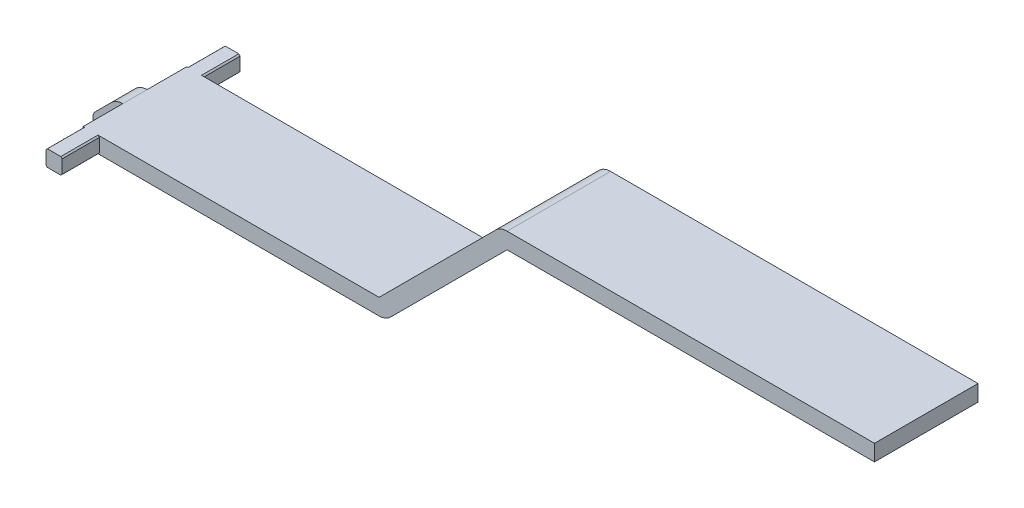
ISO-10303-21;
HEADER;
FILE_DESCRIPTION(('STEP AP214'),'2;1');
FILE_NAME('part.step','',(''),(''),'','','');
FILE_SCHEMA(('AUTOMOTIVE_DESIGN { 1 0 10303 214 1 1 1 1 }'));
ENDSEC;
DATA;
#1=APPLICATION_CONTEXT('core data for automotive mechanical design processes');
#2=APPLICATION_PROTOCOL_DEFINITION('international standard','automotive_design',2000,#1);
#3=PRODUCT_CONTEXT('',#1,'mechanical');
#4=PRODUCT('Part','Part','',(#3));
#5=PRODUCT_RELATED_PRODUCT_CATEGORY('part','',(#4));
#6=PRODUCT_DEFINITION_FORMATION('','',#4);
#7=PRODUCT_DEFINITION_CONTEXT('part definition',#1,'design');
#8=PRODUCT_DEFINITION('design','',#6,#7);
#9=PRODUCT_DEFINITION_SHAPE('','',#8);
#10=(LENGTH_UNIT() NAMED_UNIT(*) SI_UNIT(.MILLI.,.METRE.));
#11=(NAMED_UNIT(*) PLANE_ANGLE_UNIT() SI_UNIT($,.RADIAN.));
#12=(NAMED_UNIT(*) SI_UNIT($,.STERADIAN.) SOLID_ANGLE_UNIT());
#13=UNCERTAINTY_MEASURE_WITH_UNIT(LENGTH_MEASURE(1.E-05),#10,'distance_accuracy_value','');
#14=(GEOMETRIC_REPRESENTATION_CONTEXT(3) GLOBAL_UNCERTAINTY_ASSIGNED_CONTEXT((#13)) GLOBAL_UNIT_ASSIGNED_CONTEXT((#10,
#11,#12)) REPRESENTATION_CONTEXT('',''));
#15=CARTESIAN_POINT('',(0.,0.,0.));
#16=DIRECTION('',(0.,0.,1.));
#17=DIRECTION('',(1.,0.,0.));
#18=AXIS2_PLACEMENT_3D('',#15,#16,#17);
#19=CARTESIAN_POINT('',(-0.5,0.5,3.2));
#20=DIRECTION('',(1.,0.,0.));
#21=DIRECTION('',(0.,0.,-1.));
#22=AXIS2_PLACEMENT_3D('',#19,#20,#21);
#23=PLANE('',#22);
#24=DIRECTION('',(0.,1.,0.));
#25=VECTOR('',#24,1.);
#26=CARTESIAN_POINT('',(-0.5,0.5,0.75));
#27=LINE('',#26,#25);
#28=CARTESIAN_POINT('',(-0.5,-0.5,0.75));
#29=VERTEX_POINT('',#28);
#30=CARTESIAN_POINT('',(-0.5,0.5,0.75));
#31=VERTEX_POINT('',#30);
#32=EDGE_CURVE('E243',#29,#31,#27,.T.);
#33=ORIENTED_EDGE('',*,*,#32,.F.);
#34=DIRECTION('',(0.,0.,-1.));
#35=VECTOR('',#34,1.);
#36=CARTESIAN_POINT('',(-0.5,-0.5,3.2));
#37=LINE('',#36,#35);
#38=CARTESIAN_POINT('',(-0.5,-0.5,3.2));
#39=VERTEX_POINT('',#38);
#40=EDGE_CURVE('E361',#39,#29,#37,.T.);
#41=ORIENTED_EDGE('',*,*,#40,.F.);
#42=DIRECTION('',(0.,1.,0.));
#43=VECTOR('',#42,1.);
#44=CARTESIAN_POINT('',(-0.5,0.5,3.2));
#45=LINE('',#44,#43);
#46=CARTESIAN_POINT('',(-0.5,-0.415331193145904,3.2));
#47=VERTEX_POINT('',#46);
#48=EDGE_CURVE('E457',#39,#47,#45,.T.);
#49=ORIENTED_EDGE('',*,*,#48,.T.);
#50=DIRECTION('',(0.,0.,1.));
#51=VECTOR('',#50,1.);
#52=CARTESIAN_POINT('',(-0.5,-0.415331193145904,-47.129788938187));
#53=LINE('',#52,#51);
#54=CARTESIAN_POINT('',(-0.5,-0.415331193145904,5.5));
#55=VERTEX_POINT('',#54);
#56=EDGE_CURVE('E446',#55,#47,#53,.F.);
#57=ORIENTED_EDGE('',*,*,#56,.F.);
#58=DIRECTION('',(0.,-1.,0.));
#59=VECTOR('',#58,1.);
#60=CARTESIAN_POINT('',(-0.5,0.5,5.5));
#61=LINE('',#60,#59);
#62=CARTESIAN_POINT('',(-0.5,0.415331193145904,5.5));
#63=VERTEX_POINT('',#62);
#64=EDGE_CURVE('E466',#63,#55,#61,.T.);
#65=ORIENTED_EDGE('',*,*,#64,.F.);
#66=DIRECTION('',(0.,0.,1.));
#67=VECTOR('',#66,1.);
#68=CARTESIAN_POINT('',(-0.5,0.415331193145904,-47.129788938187));
#69=LINE('',#68,#67);
#70=CARTESIAN_POINT('',(-0.5,0.415331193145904,3.2));
#71=VERTEX_POINT('',#70);
#72=EDGE_CURVE('E448',#71,#63,#69,.T.);
#73=ORIENTED_EDGE('',*,*,#72,.F.);
#74=CARTESIAN_POINT('',(-0.5,0.5,3.2));
#75=VERTEX_POINT('',#74);
#76=EDGE_CURVE('E246',#71,#75,#45,.T.);
#77=ORIENTED_EDGE('',*,*,#76,.T.);
#78=DIRECTION('',(0.,0.,-1.));
#79=VECTOR('',#78,1.);
#80=CARTESIAN_POINT('',(-0.5,0.5,3.2));
#81=LINE('',#80,#79);
#82=EDGE_CURVE('E239',#75,#31,#81,.T.);
#83=ORIENTED_EDGE('',*,*,#82,.T.);
#84=EDGE_LOOP('',(#33,#41,#49,#57,#65,#73,#77,#83));
#85=FACE_BOUND('',#84,.T.);
#86=ADVANCED_FACE('F37',(#85),#23,.F.);
#87=CARTESIAN_POINT('',(0.,0.5,3.2));
#88=DIRECTION('',(0.,-1.,0.));
#89=DIRECTION('',(0.,0.,-1.));
#90=AXIS2_PLACEMENT_3D('',#87,#88,#89);
#91=PLANE('',#90);
#92=DIRECTION('',(0.,0.,-1.));
#93=VECTOR('',#92,1.);
#94=CARTESIAN_POINT('',(-0.415331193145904,0.5,47.129788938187));
#95=LINE('',#94,#93);
#96=CARTESIAN_POINT('',(-0.415331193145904,0.5,-3.2));
#97=VERTEX_POINT('',#96);
#98=CARTESIAN_POINT('',(-0.415331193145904,0.5,-5.5));
#99=VERTEX_POINT('',#98);
#100=EDGE_CURVE('E427',#97,#99,#95,.T.);
#101=ORIENTED_EDGE('',*,*,#100,.F.);
#102=DIRECTION('',(1.,0.,0.));
#103=VECTOR('',#102,1.);
#104=CARTESIAN_POINT('',(0.,0.5,-3.2));
#105=LINE('',#104,#103);
#106=CARTESIAN_POINT('',(-0.5,0.5,-3.2));
#107=VERTEX_POINT('',#106);
#108=EDGE_CURVE('E413',#107,#97,#105,.T.);
#109=ORIENTED_EDGE('',*,*,#108,.F.);
#110=CARTESIAN_POINT('',(-0.5,0.5,-0.75));
#111=VERTEX_POINT('',#110);
#112=EDGE_CURVE('E250',#111,#107,#81,.T.);
#113=ORIENTED_EDGE('',*,*,#112,.F.);
#114=DIRECTION('',(0.,0.,-1.));
#115=VECTOR('',#114,1.);
#116=CARTESIAN_POINT('',(-0.5,0.5,0.75));
#117=LINE('',#116,#115);
#118=EDGE_CURVE('E254',#31,#111,#117,.T.);
#119=ORIENTED_EDGE('',*,*,#118,.F.);
#120=ORIENTED_EDGE('',*,*,#82,.F.);
#121=DIRECTION('',(1.,0.,0.));
#122=VECTOR('',#121,1.);
#123=CARTESIAN_POINT('',(0.,0.5,3.2));
#124=LINE('',#123,#122);
#125=CARTESIAN_POINT('',(-0.415331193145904,0.5,3.2));
#126=VERTEX_POINT('',#125);
#127=EDGE_CURVE('E458',#75,#126,#124,.T.);
#128=ORIENTED_EDGE('',*,*,#127,.T.);
#129=DIRECTION('',(0.,0.,1.));
#130=VECTOR('',#129,1.);
#131=CARTESIAN_POINT('',(-0.415331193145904,0.5,-47.129788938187));
#132=LINE('',#131,#130);
#133=CARTESIAN_POINT('',(-0.415331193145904,0.5,5.5));
#134=VERTEX_POINT('',#133);
#135=EDGE_CURVE('E450',#134,#126,#132,.F.);
#136=ORIENTED_EDGE('',*,*,#135,.F.);
#137=DIRECTION('',(-1.,0.,0.));
#138=VECTOR('',#137,1.);
#139=CARTESIAN_POINT('',(-0.5,0.5,5.5));
#140=LINE('',#139,#138);
#141=CARTESIAN_POINT('',(0.415331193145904,0.5,5.5));
#142=VERTEX_POINT('',#141);
#143=EDGE_CURVE('E463',#142,#134,#140,.T.);
#144=ORIENTED_EDGE('',*,*,#143,.F.);
#145=DIRECTION('',(0.,0.,1.));
#146=VECTOR('',#145,1.);
#147=CARTESIAN_POINT('',(0.415331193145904,0.5,-47.129788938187));
#148=LINE('',#147,#146);
#149=CARTESIAN_POINT('',(0.415331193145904,0.5,3.2));
#150=VERTEX_POINT('',#149);
#151=EDGE_CURVE('E452',#150,#142,#148,.T.);
#152=ORIENTED_EDGE('',*,*,#151,.F.);
#153=DIRECTION('',(-1.,0.,0.));
#154=VECTOR('',#153,1.);
#155=CARTESIAN_POINT('',(0.,0.5,3.2));
#156=LINE('',#155,#154);
#157=CARTESIAN_POINT('',(17.7928932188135,0.5,3.2));
#158=VERTEX_POINT('',#157);
#159=EDGE_CURVE('E388',#158,#150,#156,.T.);
#160=ORIENTED_EDGE('',*,*,#159,.F.);
#161=DIRECTION('',(0.,0.,-1.));
#162=VECTOR('',#161,1.);
#163=CARTESIAN_POINT('',(17.7928932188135,0.5,3.2));
#164=LINE('',#163,#162);
#165=CARTESIAN_POINT('',(17.7928932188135,0.5,-3.2));
#166=VERTEX_POINT('',#165);
#167=EDGE_CURVE('E249',#158,#166,#164,.T.);
#168=ORIENTED_EDGE('',*,*,#167,.T.);
#169=DIRECTION('',(-1.,0.,0.));
#170=VECTOR('',#169,1.);
#171=CARTESIAN_POINT('',(0.,0.5,-3.2));
#172=LINE('',#171,#170);
#173=CARTESIAN_POINT('',(0.415331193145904,0.5,-3.2));
#174=VERTEX_POINT('',#173);
#175=EDGE_CURVE('E349',#166,#174,#172,.T.);
#176=ORIENTED_EDGE('',*,*,#175,.T.);
#177=DIRECTION('',(0.,0.,-1.));
#178=VECTOR('',#177,1.);
#179=CARTESIAN_POINT('',(0.415331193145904,0.5,47.129788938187));
#180=LINE('',#179,#178);
#181=CARTESIAN_POINT('',(0.415331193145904,0.5,-5.5));
#182=VERTEX_POINT('',#181);
#183=EDGE_CURVE('E425',#182,#174,#180,.F.);
#184=ORIENTED_EDGE('',*,*,#183,.F.);
#185=DIRECTION('',(-1.,0.,0.));
#186=VECTOR('',#185,1.);
#187=CARTESIAN_POINT('',(-0.5,0.5,-5.5));
#188=LINE('',#187,#186);
#189=EDGE_CURVE('E460',#182,#99,#188,.T.);
#190=ORIENTED_EDGE('',*,*,#189,.T.);
#191=EDGE_LOOP('',(#101,#109,#113,#119,#120,#128,#136,#144,#152,#160,#168,#176,#184,#190));
#192=FACE_BOUND('',#191,.T.);
#193=ADVANCED_FACE('F257',(#192),#91,.F.);
#194=CARTESIAN_POINT('',(-0.5,-0.5,-0.75));
#195=VERTEX_POINT('',#194);
#196=CARTESIAN_POINT('',(-0.5,-0.5,-3.2));
#197=VERTEX_POINT('',#196);
#198=EDGE_CURVE('E359',#195,#197,#37,.T.);
#199=ORIENTED_EDGE('',*,*,#198,.F.);
#200=DIRECTION('',(0.,1.,0.));
#201=VECTOR('',#200,1.);
#202=CARTESIAN_POINT('',(-0.5,0.5,-0.75));
#203=LINE('',#202,#201);
#204=EDGE_CURVE('E296',#195,#111,#203,.T.);
#205=ORIENTED_EDGE('',*,*,#204,.T.);
#206=ORIENTED_EDGE('',*,*,#112,.T.);
#207=DIRECTION('',(0.,1.,0.));
#208=VECTOR('',#207,1.);
#209=CARTESIAN_POINT('',(-0.5,0.5,-3.2));
#210=LINE('',#209,#208);
#211=CARTESIAN_POINT('',(-0.5,0.415331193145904,-3.2));
#212=VERTEX_POINT('',#211);
#213=EDGE_CURVE('E416',#212,#107,#210,.T.);
#214=ORIENTED_EDGE('',*,*,#213,.F.);
#215=DIRECTION('',(0.,0.,-1.));
#216=VECTOR('',#215,1.);
#217=CARTESIAN_POINT('',(-0.5,0.415331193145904,47.129788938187));
#218=LINE('',#217,#216);
#219=CARTESIAN_POINT('',(-0.5,0.415331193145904,-5.5));
#220=VERTEX_POINT('',#219);
#221=EDGE_CURVE('E421',#220,#212,#218,.F.);
#222=ORIENTED_EDGE('',*,*,#221,.F.);
#223=DIRECTION('',(0.,-1.,0.));
#224=VECTOR('',#223,1.);
#225=CARTESIAN_POINT('',(-0.5,0.5,-5.5));
#226=LINE('',#225,#224);
#227=CARTESIAN_POINT('',(-0.5,-0.415331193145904,-5.5));
#228=VERTEX_POINT('',#227);
#229=EDGE_CURVE('E477',#220,#228,#226,.T.);
#230=ORIENTED_EDGE('',*,*,#229,.T.);
#231=DIRECTION('',(0.,0.,-1.));
#232=VECTOR('',#231,1.);
#233=CARTESIAN_POINT('',(-0.5,-0.415331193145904,47.129788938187));
#234=LINE('',#233,#232);
#235=CARTESIAN_POINT('',(-0.5,-0.415331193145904,-3.2));
#236=VERTEX_POINT('',#235);
#237=EDGE_CURVE('E423',#236,#228,#234,.T.);
#238=ORIENTED_EDGE('',*,*,#237,.F.);
#239=EDGE_CURVE('E412',#197,#236,#210,.T.);
#240=ORIENTED_EDGE('',*,*,#239,.F.);
#241=EDGE_LOOP('',(#199,#205,#206,#214,#222,#230,#238,#240));
#242=FACE_BOUND('',#241,.T.);
#243=ADVANCED_FACE('F507',(#242),#23,.F.);
#244=CARTESIAN_POINT('',(0.,-0.5,3.2));
#245=DIRECTION('',(0.,1.,0.));
#246=DIRECTION('',(0.,0.,1.));
#247=AXIS2_PLACEMENT_3D('',#244,#245,#246);
#248=PLANE('',#247);
#249=DIRECTION('',(1.,0.,0.));
#250=VECTOR('',#249,1.);
#251=CARTESIAN_POINT('',(0.,-0.5,-3.2));
#252=LINE('',#251,#250);
#253=CARTESIAN_POINT('',(0.415331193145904,-0.5,-3.2));
#254=VERTEX_POINT('',#253);
#255=CARTESIAN_POINT('',(17.7928932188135,-0.5,-3.2));
#256=VERTEX_POINT('',#255);
#257=EDGE_CURVE('E351',#254,#256,#252,.T.);
#258=ORIENTED_EDGE('',*,*,#257,.T.);
#259=DIRECTION('',(0.,0.,-1.));
#260=VECTOR('',#259,1.);
#261=CARTESIAN_POINT('',(17.7928932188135,-0.5,3.2));
#262=LINE('',#261,#260);
#263=CARTESIAN_POINT('',(17.7928932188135,-0.5,3.2));
#264=VERTEX_POINT('',#263);
#265=EDGE_CURVE('E12',#256,#264,#262,.F.);
#266=ORIENTED_EDGE('',*,*,#265,.T.);
#267=DIRECTION('',(1.,0.,0.));
#268=VECTOR('',#267,1.);
#269=CARTESIAN_POINT('',(-0.5,-0.5,3.2));
#270=LINE('',#269,#268);
#271=CARTESIAN_POINT('',(0.415331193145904,-0.5,3.2));
#272=VERTEX_POINT('',#271);
#273=EDGE_CURVE('E340',#272,#264,#270,.T.);
#274=ORIENTED_EDGE('',*,*,#273,.F.);
#275=DIRECTION('',(0.,0.,1.));
#276=VECTOR('',#275,1.);
#277=CARTESIAN_POINT('',(0.415331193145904,-0.5,-47.129788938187));
#278=LINE('',#277,#276);
#279=CARTESIAN_POINT('',(0.415331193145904,-0.5,5.5));
#280=VERTEX_POINT('',#279);
#281=EDGE_CURVE('E441',#280,#272,#278,.F.);
#282=ORIENTED_EDGE('',*,*,#281,.F.);
#283=DIRECTION('',(1.,0.,0.));
#284=VECTOR('',#283,1.);
#285=CARTESIAN_POINT('',(-0.5,-0.5,5.5));
#286=LINE('',#285,#284);
#287=CARTESIAN_POINT('',(-0.415331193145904,-0.5,5.5));
#288=VERTEX_POINT('',#287);
#289=EDGE_CURVE('E470',#288,#280,#286,.T.);
#290=ORIENTED_EDGE('',*,*,#289,.F.);
#291=DIRECTION('',(0.,0.,1.));
#292=VECTOR('',#291,1.);
#293=CARTESIAN_POINT('',(-0.415331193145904,-0.5,-47.129788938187));
#294=LINE('',#293,#292);
#295=CARTESIAN_POINT('',(-0.415331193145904,-0.5,3.2));
#296=VERTEX_POINT('',#295);
#297=EDGE_CURVE('E444',#296,#288,#294,.T.);
#298=ORIENTED_EDGE('',*,*,#297,.F.);
#299=DIRECTION('',(-1.,0.,0.));
#300=VECTOR('',#299,1.);
#301=CARTESIAN_POINT('',(0.,-0.5,3.2));
#302=LINE('',#301,#300);
#303=EDGE_CURVE('E454',#296,#39,#302,.T.);
#304=ORIENTED_EDGE('',*,*,#303,.T.);
#305=ORIENTED_EDGE('',*,*,#40,.T.);
#306=DIRECTION('',(0.,0.,-1.));
#307=VECTOR('',#306,1.);
#308=CARTESIAN_POINT('',(-0.5,-0.5,0.75));
#309=LINE('',#308,#307);
#310=EDGE_CURVE('E500',#29,#195,#309,.T.);
#311=ORIENTED_EDGE('',*,*,#310,.T.);
#312=ORIENTED_EDGE('',*,*,#198,.T.);
#313=DIRECTION('',(-1.,0.,0.));
#314=VECTOR('',#313,1.);
#315=CARTESIAN_POINT('',(0.,-0.5,-3.2));
#316=LINE('',#315,#314);
#317=CARTESIAN_POINT('',(-0.415331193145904,-0.5,-3.2));
#318=VERTEX_POINT('',#317);
#319=EDGE_CURVE('E408',#318,#197,#316,.T.);
#320=ORIENTED_EDGE('',*,*,#319,.F.);
#321=DIRECTION('',(0.,0.,-1.));
#322=VECTOR('',#321,1.);
#323=CARTESIAN_POINT('',(-0.415331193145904,-0.5,47.129788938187));
#324=LINE('',#323,#322);
#325=CARTESIAN_POINT('',(-0.415331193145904,-0.5,-5.5));
#326=VERTEX_POINT('',#325);
#327=EDGE_CURVE('E415',#326,#318,#324,.F.);
#328=ORIENTED_EDGE('',*,*,#327,.F.);
#329=DIRECTION('',(1.,0.,0.));
#330=VECTOR('',#329,1.);
#331=CARTESIAN_POINT('',(-0.5,-0.5,-5.5));
#332=LINE('',#331,#330);
#333=CARTESIAN_POINT('',(0.415331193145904,-0.5,-5.5));
#334=VERTEX_POINT('',#333);
#335=EDGE_CURVE('E480',#326,#334,#332,.T.);
#336=ORIENTED_EDGE('',*,*,#335,.T.);
#337=DIRECTION('',(0.,0.,-1.));
#338=VECTOR('',#337,1.);
#339=CARTESIAN_POINT('',(0.415331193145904,-0.5,47.129788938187));
#340=LINE('',#339,#338);
#341=EDGE_CURVE('E419',#254,#334,#340,.T.);
#342=ORIENTED_EDGE('',*,*,#341,.F.);
#343=EDGE_LOOP('',(#258,#266,#274,#282,#290,#298,#304,#305,#311,#312,#320,#328,#336,#342));
#344=FACE_BOUND('',#343,.T.);
#345=ADVANCED_FACE('F498',(#344),#248,.F.);
#346=CARTESIAN_POINT('',(0.5,0.5,-5.5));
#347=DIRECTION('',(0.,0.,-1.));
#348=DIRECTION('',(-1.,0.,0.));
#349=AXIS2_PLACEMENT_3D('',#346,#347,#348);
#350=PLANE('',#349);
#351=ORIENTED_EDGE('',*,*,#229,.F.);
#352=CARTESIAN_POINT('',(0.,0.,-5.5));
#353=DIRECTION('',(0.,0.,-1.));
#354=DIRECTION('',(-1.,0.,0.));
#355=AXIS2_PLACEMENT_3D('',#352,#353,#354);
#356=CIRCLE('',#355,0.65);
#357=EDGE_CURVE('E404',#220,#99,#356,.T.);
#358=ORIENTED_EDGE('',*,*,#357,.T.);
#359=ORIENTED_EDGE('',*,*,#189,.F.);
#360=CARTESIAN_POINT('',(0.5,0.415331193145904,-5.5));
#361=VERTEX_POINT('',#360);
#362=EDGE_CURVE('E519',#182,#361,#356,.T.);
#363=ORIENTED_EDGE('',*,*,#362,.T.);
#364=DIRECTION('',(0.,1.,0.));
#365=VECTOR('',#364,1.);
#366=CARTESIAN_POINT('',(0.5,0.5,-5.5));
#367=LINE('',#366,#365);
#368=CARTESIAN_POINT('',(0.5,-0.415331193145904,-5.5));
#369=VERTEX_POINT('',#368);
#370=EDGE_CURVE('E467',#369,#361,#367,.T.);
#371=ORIENTED_EDGE('',*,*,#370,.F.);
#372=EDGE_CURVE('E518',#369,#334,#356,.T.);
#373=ORIENTED_EDGE('',*,*,#372,.T.);
#374=ORIENTED_EDGE('',*,*,#335,.F.);
#375=EDGE_CURVE('E261',#326,#228,#356,.T.);
#376=ORIENTED_EDGE('',*,*,#375,.T.);
#377=EDGE_LOOP('',(#351,#358,#359,#363,#371,#373,#374,#376));
#378=FACE_BOUND('',#377,.T.);
#379=ADVANCED_FACE('F515',(#378),#350,.T.);
#380=CARTESIAN_POINT('',(0.5,0.5,5.5));
#381=DIRECTION('',(-1.,0.,0.));
#382=DIRECTION('',(0.,-1.,0.));
#383=AXIS2_PLACEMENT_3D('',#380,#381,#382);
#384=PLANE('',#383);
#385=DIRECTION('',(0.,0.,-1.));
#386=VECTOR('',#385,1.);
#387=CARTESIAN_POINT('',(0.5,0.415331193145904,47.129788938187));
#388=LINE('',#387,#386);
#389=CARTESIAN_POINT('',(0.5,0.415331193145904,-3.2));
#390=VERTEX_POINT('',#389);
#391=EDGE_CURVE('E308',#390,#361,#388,.T.);
#392=ORIENTED_EDGE('',*,*,#391,.F.);
#393=DIRECTION('',(0.,1.,0.));
#394=VECTOR('',#393,1.);
#395=CARTESIAN_POINT('',(0.5,7.,-3.2));
#396=LINE('',#395,#394);
#397=CARTESIAN_POINT('',(0.500000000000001,-0.415331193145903,-3.2));
#398=VERTEX_POINT('',#397);
#399=EDGE_CURVE('E371',#398,#390,#396,.T.);
#400=ORIENTED_EDGE('',*,*,#399,.F.);
#401=DIRECTION('',(0.,0.,-1.));
#402=VECTOR('',#401,1.);
#403=CARTESIAN_POINT('',(0.5,-0.415331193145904,47.129788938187));
#404=LINE('',#403,#402);
#405=EDGE_CURVE('E364',#369,#398,#404,.F.);
#406=ORIENTED_EDGE('',*,*,#405,.F.);
#407=ORIENTED_EDGE('',*,*,#370,.T.);
#408=EDGE_LOOP('',(#392,#400,#406,#407));
#409=FACE_BOUND('',#408,.T.);
#410=ADVANCED_FACE('F525',(#409),#384,.F.);
#411=DIRECTION('',(0.,0.,1.));
#412=VECTOR('',#411,1.);
#413=CARTESIAN_POINT('',(0.5,-0.415331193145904,-47.129788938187));
#414=LINE('',#413,#412);
#415=CARTESIAN_POINT('',(0.5,-0.415331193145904,3.2));
#416=VERTEX_POINT('',#415);
#417=CARTESIAN_POINT('',(0.5,-0.415331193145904,5.5));
#418=VERTEX_POINT('',#417);
#419=EDGE_CURVE('E439',#416,#418,#414,.T.);
#420=ORIENTED_EDGE('',*,*,#419,.F.);
#421=DIRECTION('',(0.,1.,0.));
#422=VECTOR('',#421,1.);
#423=CARTESIAN_POINT('',(0.5,7.,3.2));
#424=LINE('',#423,#422);
#425=CARTESIAN_POINT('',(0.5,0.415331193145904,3.2));
#426=VERTEX_POINT('',#425);
#427=EDGE_CURVE('E332',#416,#426,#424,.T.);
#428=ORIENTED_EDGE('',*,*,#427,.T.);
#429=DIRECTION('',(0.,0.,1.));
#430=VECTOR('',#429,1.);
#431=CARTESIAN_POINT('',(0.5,0.415331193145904,-47.129788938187));
#432=LINE('',#431,#430);
#433=CARTESIAN_POINT('',(0.5,0.415331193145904,5.5));
#434=VERTEX_POINT('',#433);
#435=EDGE_CURVE('E436',#434,#426,#432,.F.);
#436=ORIENTED_EDGE('',*,*,#435,.F.);
#437=DIRECTION('',(0.,1.,0.));
#438=VECTOR('',#437,1.);
#439=CARTESIAN_POINT('',(0.5,0.5,5.5));
#440=LINE('',#439,#438);
#441=EDGE_CURVE('E337',#418,#434,#440,.T.);
#442=ORIENTED_EDGE('',*,*,#441,.F.);
#443=EDGE_LOOP('',(#420,#428,#436,#442));
#444=FACE_BOUND('',#443,.T.);
#445=ADVANCED_FACE('F563',(#444),#384,.F.);
#446=CARTESIAN_POINT('',(0.5,0.5,5.5));
#447=DIRECTION('',(0.,0.,-1.));
#448=DIRECTION('',(-1.,0.,0.));
#449=AXIS2_PLACEMENT_3D('',#446,#447,#448);
#450=PLANE('',#449);
#451=CARTESIAN_POINT('',(0.,0.,5.5));
#452=DIRECTION('',(0.,0.,-1.));
#453=DIRECTION('',(-1.,0.,0.));
#454=AXIS2_PLACEMENT_3D('',#451,#452,#453);
#455=CIRCLE('',#454,0.65);
#456=EDGE_CURVE('E367',#63,#134,#455,.T.);
#457=ORIENTED_EDGE('',*,*,#456,.F.);
#458=ORIENTED_EDGE('',*,*,#64,.T.);
#459=EDGE_CURVE('E368',#288,#55,#455,.T.);
#460=ORIENTED_EDGE('',*,*,#459,.F.);
#461=ORIENTED_EDGE('',*,*,#289,.T.);
#462=EDGE_CURVE('E370',#418,#280,#455,.T.);
#463=ORIENTED_EDGE('',*,*,#462,.F.);
#464=ORIENTED_EDGE('',*,*,#441,.T.);
#465=CARTESIAN_POINT('',(0.,0.,5.5));
#466=DIRECTION('',(0.,0.,1.));
#467=DIRECTION('',(1.,0.,0.));
#468=AXIS2_PLACEMENT_3D('',#465,#466,#467);
#469=CIRCLE('',#468,0.65);
#470=EDGE_CURVE('E429',#434,#142,#469,.T.);
#471=ORIENTED_EDGE('',*,*,#470,.T.);
#472=ORIENTED_EDGE('',*,*,#143,.T.);
#473=EDGE_LOOP('',(#457,#458,#460,#461,#463,#464,#471,#472));
#474=FACE_BOUND('',#473,.T.);
#475=ADVANCED_FACE('F559',(#474),#450,.F.);
#476=CARTESIAN_POINT('',(25.7071067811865,7.,3.2));
#477=DIRECTION('',(0.,0.,-1.));
#478=DIRECTION('',(-1.,0.,0.));
#479=AXIS2_PLACEMENT_3D('',#476,#477,#478);
#480=PLANE('',#479);
#481=DIRECTION('',(-1.,0.,0.));
#482=VECTOR('',#481,1.);
#483=CARTESIAN_POINT('',(25.2928932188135,8.,3.2));
#484=LINE('',#483,#482);
#485=CARTESIAN_POINT('',(48.422618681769,8.,3.2));
#486=VERTEX_POINT('',#485);
#487=CARTESIAN_POINT('',(25.7071067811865,8.,3.2));
#488=VERTEX_POINT('',#487);
#489=EDGE_CURVE('E490',#486,#488,#484,.T.);
#490=ORIENTED_EDGE('',*,*,#489,.T.);
#491=CARTESIAN_POINT('',(25.7071067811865,7.,3.2));
#492=DIRECTION('',(0.,0.,-1.));
#493=DIRECTION('',(-1.,0.,0.));
#494=AXIS2_PLACEMENT_3D('',#491,#492,#493);
#495=CIRCLE('',#494,1.);
#496=CARTESIAN_POINT('',(25.,7.70710678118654,3.2));
#497=VERTEX_POINT('',#496);
#498=EDGE_CURVE('E315',#488,#497,#495,.F.);
#499=ORIENTED_EDGE('',*,*,#498,.T.);
#500=DIRECTION('',(-0.707106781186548,-0.707106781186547,0.));
#501=VECTOR('',#500,1.);
#502=CARTESIAN_POINT('',(17.7928932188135,0.5,3.2));
#503=LINE('',#502,#501);
#504=EDGE_CURVE('E392',#497,#158,#503,.T.);
#505=ORIENTED_EDGE('',*,*,#504,.T.);
#506=ORIENTED_EDGE('',*,*,#159,.T.);
#507=CARTESIAN_POINT('',(0.,0.,3.2));
#508=DIRECTION('',(0.,0.,-1.));
#509=DIRECTION('',(-1.,0.,0.));
#510=AXIS2_PLACEMENT_3D('',#507,#508,#509);
#511=CIRCLE('',#510,0.65);
#512=EDGE_CURVE('E839',#426,#150,#511,.F.);
#513=ORIENTED_EDGE('',*,*,#512,.F.);
#514=ORIENTED_EDGE('',*,*,#427,.F.);
#515=EDGE_CURVE('E437',#272,#416,#511,.F.);
#516=ORIENTED_EDGE('',*,*,#515,.F.);
#517=ORIENTED_EDGE('',*,*,#273,.T.);
#518=CARTESIAN_POINT('',(17.7928932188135,0.5,3.2));
#519=DIRECTION('',(0.,0.,-1.));
#520=DIRECTION('',(-1.,0.,0.));
#521=AXIS2_PLACEMENT_3D('',#518,#519,#520);
#522=CIRCLE('',#521,1.);
#523=CARTESIAN_POINT('',(18.5,-0.207106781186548,3.2));
#524=VERTEX_POINT('',#523);
#525=EDGE_CURVE('E52',#264,#524,#522,.F.);
#526=ORIENTED_EDGE('',*,*,#525,.T.);
#527=DIRECTION('',(0.707106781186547,0.707106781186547,0.));
#528=VECTOR('',#527,1.);
#529=CARTESIAN_POINT('',(18.2071067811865,-0.5,3.2));
#530=LINE('',#529,#528);
#531=CARTESIAN_POINT('',(25.7071067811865,7.,3.2));
#532=VERTEX_POINT('',#531);
#533=EDGE_CURVE('E324',#524,#532,#530,.T.);
#534=ORIENTED_EDGE('',*,*,#533,.T.);
#535=DIRECTION('',(1.,0.,0.));
#536=VECTOR('',#535,1.);
#537=CARTESIAN_POINT('',(25.7071067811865,7.,3.2));
#538=LINE('',#537,#536);
#539=CARTESIAN_POINT('',(48.422618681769,7.,3.2));
#540=VERTEX_POINT('',#539);
#541=EDGE_CURVE('E486',#532,#540,#538,.T.);
#542=ORIENTED_EDGE('',*,*,#541,.T.);
#543=DIRECTION('',(0.,1.,0.));
#544=VECTOR('',#543,1.);
#545=CARTESIAN_POINT('',(48.422618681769,8.,3.2));
#546=LINE('',#545,#544);
#547=EDGE_CURVE('E488',#540,#486,#546,.T.);
#548=ORIENTED_EDGE('',*,*,#547,.T.);
#549=EDGE_LOOP('',(#490,#499,#505,#506,#513,#514,#516,#517,#526,#534,#542,#548));
#550=FACE_BOUND('',#549,.T.);
#551=ADVANCED_FACE('F555',(#550),#480,.F.);
#552=CARTESIAN_POINT('',(25.7071067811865,7.,-3.2));
#553=DIRECTION('',(0.,0.,-1.));
#554=DIRECTION('',(-1.,0.,0.));
#555=AXIS2_PLACEMENT_3D('',#552,#553,#554);
#556=PLANE('',#555);
#557=DIRECTION('',(-0.707106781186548,-0.707106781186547,0.));
#558=VECTOR('',#557,1.);
#559=CARTESIAN_POINT('',(17.7928932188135,0.5,-3.2));
#560=LINE('',#559,#558);
#561=CARTESIAN_POINT('',(25.,7.70710678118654,-3.2));
#562=VERTEX_POINT('',#561);
#563=EDGE_CURVE('E347',#562,#166,#560,.T.);
#564=ORIENTED_EDGE('',*,*,#563,.F.);
#565=CARTESIAN_POINT('',(25.7071067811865,7.,-3.2));
#566=DIRECTION('',(0.,0.,-1.));
#567=DIRECTION('',(-1.,0.,0.));
#568=AXIS2_PLACEMENT_3D('',#565,#566,#567);
#569=CIRCLE('',#568,1.);
#570=CARTESIAN_POINT('',(25.7071067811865,8.,-3.2));
#571=VERTEX_POINT('',#570);
#572=EDGE_CURVE('E310',#562,#571,#569,.T.);
#573=ORIENTED_EDGE('',*,*,#572,.T.);
#574=DIRECTION('',(-1.,0.,0.));
#575=VECTOR('',#574,1.);
#576=CARTESIAN_POINT('',(25.2928932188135,8.,-3.2));
#577=LINE('',#576,#575);
#578=CARTESIAN_POINT('',(48.422618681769,8.,-3.2));
#579=VERTEX_POINT('',#578);
#580=EDGE_CURVE('E344',#579,#571,#577,.T.);
#581=ORIENTED_EDGE('',*,*,#580,.F.);
#582=DIRECTION('',(0.,1.,0.));
#583=VECTOR('',#582,1.);
#584=CARTESIAN_POINT('',(48.422618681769,8.,-3.2));
#585=LINE('',#584,#583);
#586=CARTESIAN_POINT('',(48.422618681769,7.,-3.2));
#587=VERTEX_POINT('',#586);
#588=EDGE_CURVE('E334',#587,#579,#585,.T.);
#589=ORIENTED_EDGE('',*,*,#588,.F.);
#590=DIRECTION('',(1.,0.,0.));
#591=VECTOR('',#590,1.);
#592=CARTESIAN_POINT('',(25.7071067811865,7.,-3.2));
#593=LINE('',#592,#591);
#594=CARTESIAN_POINT('',(25.7071067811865,7.,-3.2));
#595=VERTEX_POINT('',#594);
#596=EDGE_CURVE('E330',#595,#587,#593,.T.);
#597=ORIENTED_EDGE('',*,*,#596,.F.);
#598=DIRECTION('',(0.707106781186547,0.707106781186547,0.));
#599=VECTOR('',#598,1.);
#600=CARTESIAN_POINT('',(18.2071067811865,-0.5,-3.2));
#601=LINE('',#600,#599);
#602=CARTESIAN_POINT('',(18.5,-0.207106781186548,-3.2));
#603=VERTEX_POINT('',#602);
#604=EDGE_CURVE('E322',#603,#595,#601,.T.);
#605=ORIENTED_EDGE('',*,*,#604,.F.);
#606=CARTESIAN_POINT('',(17.7928932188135,0.5,-3.2));
#607=DIRECTION('',(0.,0.,-1.));
#608=DIRECTION('',(-1.,0.,0.));
#609=AXIS2_PLACEMENT_3D('',#606,#607,#608);
#610=CIRCLE('',#609,1.);
#611=EDGE_CURVE('E307',#603,#256,#610,.T.);
#612=ORIENTED_EDGE('',*,*,#611,.T.);
#613=ORIENTED_EDGE('',*,*,#257,.F.);
#614=CARTESIAN_POINT('',(0.,0.,-3.2));
#615=DIRECTION('',(0.,0.,-1.));
#616=DIRECTION('',(-1.,0.,0.));
#617=AXIS2_PLACEMENT_3D('',#614,#615,#616);
#618=CIRCLE('',#617,0.65);
#619=EDGE_CURVE('E399',#254,#398,#618,.F.);
#620=ORIENTED_EDGE('',*,*,#619,.T.);
#621=ORIENTED_EDGE('',*,*,#399,.T.);
#622=EDGE_CURVE('E395',#390,#174,#618,.F.);
#623=ORIENTED_EDGE('',*,*,#622,.T.);
#624=ORIENTED_EDGE('',*,*,#175,.F.);
#625=EDGE_LOOP('',(#564,#573,#581,#589,#597,#605,#612,#613,#620,#621,#623,#624));
#626=FACE_BOUND('',#625,.T.);
#627=ADVANCED_FACE('F328',(#626),#556,.T.);
#628=CARTESIAN_POINT('',(18.2071067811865,-0.5,3.2));
#629=DIRECTION('',(-0.707106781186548,0.707106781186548,0.));
#630=DIRECTION('',(-0.707106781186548,-0.707106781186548,0.));
#631=AXIS2_PLACEMENT_3D('',#628,#629,#630);
#632=PLANE('',#631);
#633=ORIENTED_EDGE('',*,*,#533,.F.);
#634=DIRECTION('',(0.,0.,-1.));
#635=VECTOR('',#634,1.);
#636=CARTESIAN_POINT('',(18.5,-0.207106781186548,3.2));
#637=LINE('',#636,#635);
#638=EDGE_CURVE('E45',#524,#603,#637,.T.);
#639=ORIENTED_EDGE('',*,*,#638,.T.);
#640=ORIENTED_EDGE('',*,*,#604,.T.);
#641=DIRECTION('',(0.,0.,-1.));
#642=VECTOR('',#641,1.);
#643=CARTESIAN_POINT('',(25.7071067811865,7.,3.2));
#644=LINE('',#643,#642);
#645=EDGE_CURVE('E374',#532,#595,#644,.T.);
#646=ORIENTED_EDGE('',*,*,#645,.F.);
#647=EDGE_LOOP('',(#633,#639,#640,#646));
#648=FACE_BOUND('',#647,.T.);
#649=ADVANCED_FACE('F320',(#648),#632,.F.);
#650=CARTESIAN_POINT('',(25.7071067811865,7.,3.2));
#651=DIRECTION('',(0.,1.,0.));
#652=DIRECTION('',(0.,0.,1.));
#653=AXIS2_PLACEMENT_3D('',#650,#651,#652);
#654=PLANE('',#653);
#655=ORIENTED_EDGE('',*,*,#596,.T.);
#656=DIRECTION('',(0.,0.,-1.));
#657=VECTOR('',#656,1.);
#658=CARTESIAN_POINT('',(48.422618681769,7.,3.2));
#659=LINE('',#658,#657);
#660=EDGE_CURVE('E376',#540,#587,#659,.T.);
#661=ORIENTED_EDGE('',*,*,#660,.F.);
#662=ORIENTED_EDGE('',*,*,#541,.F.);
#663=ORIENTED_EDGE('',*,*,#645,.T.);
#664=EDGE_LOOP('',(#655,#661,#662,#663));
#665=FACE_BOUND('',#664,.T.);
#666=ADVANCED_FACE('F646',(#665),#654,.F.);
#667=CARTESIAN_POINT('',(48.422618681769,8.,3.2));
#668=DIRECTION('',(-1.,0.,0.));
#669=DIRECTION('',(0.,0.,1.));
#670=AXIS2_PLACEMENT_3D('',#667,#668,#669);
#671=PLANE('',#670);
#672=ORIENTED_EDGE('',*,*,#588,.T.);
#673=DIRECTION('',(0.,0.,-1.));
#674=VECTOR('',#673,1.);
#675=CARTESIAN_POINT('',(48.422618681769,8.,3.2));
#676=LINE('',#675,#674);
#677=EDGE_CURVE('E379',#486,#579,#676,.T.);
#678=ORIENTED_EDGE('',*,*,#677,.F.);
#679=ORIENTED_EDGE('',*,*,#547,.F.);
#680=ORIENTED_EDGE('',*,*,#660,.T.);
#681=EDGE_LOOP('',(#672,#678,#679,#680));
#682=FACE_BOUND('',#681,.T.);
#683=ADVANCED_FACE('F634',(#682),#671,.F.);
#684=CARTESIAN_POINT('',(25.2928932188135,8.,3.2));
#685=DIRECTION('',(0.,-1.,0.));
#686=DIRECTION('',(0.,0.,-1.));
#687=AXIS2_PLACEMENT_3D('',#684,#685,#686);
#688=PLANE('',#687);
#689=ORIENTED_EDGE('',*,*,#580,.T.);
#690=DIRECTION('',(0.,0.,-1.));
#691=VECTOR('',#690,1.);
#692=CARTESIAN_POINT('',(25.7071067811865,8.,3.2));
#693=LINE('',#692,#691);
#694=EDGE_CURVE('E312',#571,#488,#693,.F.);
#695=ORIENTED_EDGE('',*,*,#694,.T.);
#696=ORIENTED_EDGE('',*,*,#489,.F.);
#697=ORIENTED_EDGE('',*,*,#677,.T.);
#698=EDGE_LOOP('',(#689,#695,#696,#697));
#699=FACE_BOUND('',#698,.T.);
#700=ADVANCED_FACE('F623',(#699),#688,.F.);
#701=CARTESIAN_POINT('',(17.7928932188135,0.5,3.2));
#702=DIRECTION('',(0.707106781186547,-0.707106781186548,0.));
#703=DIRECTION('',(0.707106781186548,0.707106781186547,0.));
#704=AXIS2_PLACEMENT_3D('',#701,#702,#703);
#705=PLANE('',#704);
#706=ORIENTED_EDGE('',*,*,#504,.F.);
#707=DIRECTION('',(0.,0.,-1.));
#708=VECTOR('',#707,1.);
#709=CARTESIAN_POINT('',(25.,7.70710678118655,3.2));
#710=LINE('',#709,#708);
#711=EDGE_CURVE('E304',#497,#562,#710,.T.);
#712=ORIENTED_EDGE('',*,*,#711,.T.);
#713=ORIENTED_EDGE('',*,*,#563,.T.);
#714=ORIENTED_EDGE('',*,*,#167,.F.);
#715=EDGE_LOOP('',(#706,#712,#713,#714));
#716=FACE_BOUND('',#715,.T.);
#717=ADVANCED_FACE('F391',(#716),#705,.F.);
#718=CARTESIAN_POINT('',(0.,0.,-47.129788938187));
#719=DIRECTION('',(0.,0.,1.));
#720=DIRECTION('',(1.,0.,0.));
#721=AXIS2_PLACEMENT_3D('',#718,#719,#720);
#722=CYLINDRICAL_SURFACE('',#721,0.65);
#723=ORIENTED_EDGE('',*,*,#56,.T.);
#724=EDGE_CURVE('E433',#47,#296,#511,.F.);
#725=ORIENTED_EDGE('',*,*,#724,.T.);
#726=ORIENTED_EDGE('',*,*,#297,.T.);
#727=ORIENTED_EDGE('',*,*,#459,.T.);
#728=EDGE_LOOP('',(#723,#725,#726,#727));
#729=FACE_BOUND('',#728,.T.);
#730=ADVANCED_FACE('F622',(#729),#722,.T.);
#731=ORIENTED_EDGE('',*,*,#303,.F.);
#732=ORIENTED_EDGE('',*,*,#724,.F.);
#733=ORIENTED_EDGE('',*,*,#48,.F.);
#734=EDGE_LOOP('',(#731,#732,#733));
#735=FACE_BOUND('',#734,.T.);
#736=ADVANCED_FACE('F561',(#735),#480,.F.);
#737=ORIENTED_EDGE('',*,*,#281,.T.);
#738=ORIENTED_EDGE('',*,*,#515,.T.);
#739=ORIENTED_EDGE('',*,*,#419,.T.);
#740=ORIENTED_EDGE('',*,*,#462,.T.);
#741=EDGE_LOOP('',(#737,#738,#739,#740));
#742=FACE_BOUND('',#741,.T.);
#743=ADVANCED_FACE('F571',(#742),#722,.T.);
#744=ORIENTED_EDGE('',*,*,#151,.T.);
#745=ORIENTED_EDGE('',*,*,#470,.F.);
#746=ORIENTED_EDGE('',*,*,#435,.T.);
#747=ORIENTED_EDGE('',*,*,#512,.T.);
#748=EDGE_LOOP('',(#744,#745,#746,#747));
#749=FACE_BOUND('',#748,.T.);
#750=ADVANCED_FACE('F568',(#749),#722,.T.);
#751=ORIENTED_EDGE('',*,*,#76,.F.);
#752=EDGE_CURVE('E432',#126,#71,#511,.F.);
#753=ORIENTED_EDGE('',*,*,#752,.F.);
#754=ORIENTED_EDGE('',*,*,#127,.F.);
#755=EDGE_LOOP('',(#751,#753,#754));
#756=FACE_BOUND('',#755,.T.);
#757=ADVANCED_FACE('F560',(#756),#480,.F.);
#758=ORIENTED_EDGE('',*,*,#135,.T.);
#759=ORIENTED_EDGE('',*,*,#752,.T.);
#760=ORIENTED_EDGE('',*,*,#72,.T.);
#761=ORIENTED_EDGE('',*,*,#456,.T.);
#762=EDGE_LOOP('',(#758,#759,#760,#761));
#763=FACE_BOUND('',#762,.T.);
#764=ADVANCED_FACE('F573',(#763),#722,.T.);
#765=CARTESIAN_POINT('',(0.,0.,47.129788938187));
#766=DIRECTION('',(0.,0.,-1.));
#767=DIRECTION('',(-1.,0.,0.));
#768=AXIS2_PLACEMENT_3D('',#765,#766,#767);
#769=CYLINDRICAL_SURFACE('',#768,0.65);
#770=ORIENTED_EDGE('',*,*,#341,.T.);
#771=ORIENTED_EDGE('',*,*,#372,.F.);
#772=ORIENTED_EDGE('',*,*,#405,.T.);
#773=ORIENTED_EDGE('',*,*,#619,.F.);
#774=EDGE_LOOP('',(#770,#771,#772,#773));
#775=FACE_BOUND('',#774,.T.);
#776=ADVANCED_FACE('F528',(#775),#769,.T.);
#777=ORIENTED_EDGE('',*,*,#183,.T.);
#778=ORIENTED_EDGE('',*,*,#622,.F.);
#779=ORIENTED_EDGE('',*,*,#391,.T.);
#780=ORIENTED_EDGE('',*,*,#362,.F.);
#781=EDGE_LOOP('',(#777,#778,#779,#780));
#782=FACE_BOUND('',#781,.T.);
#783=ADVANCED_FACE('F578',(#782),#769,.T.);
#784=ORIENTED_EDGE('',*,*,#237,.T.);
#785=ORIENTED_EDGE('',*,*,#375,.F.);
#786=ORIENTED_EDGE('',*,*,#327,.T.);
#787=EDGE_CURVE('E402',#236,#318,#618,.F.);
#788=ORIENTED_EDGE('',*,*,#787,.F.);
#789=EDGE_LOOP('',(#784,#785,#786,#788));
#790=FACE_BOUND('',#789,.T.);
#791=ADVANCED_FACE('F512',(#790),#769,.T.);
#792=ORIENTED_EDGE('',*,*,#239,.T.);
#793=ORIENTED_EDGE('',*,*,#787,.T.);
#794=ORIENTED_EDGE('',*,*,#319,.T.);
#795=EDGE_LOOP('',(#792,#793,#794));
#796=FACE_BOUND('',#795,.T.);
#797=ADVANCED_FACE('F504',(#796),#556,.T.);
#798=ORIENTED_EDGE('',*,*,#100,.T.);
#799=ORIENTED_EDGE('',*,*,#357,.F.);
#800=ORIENTED_EDGE('',*,*,#221,.T.);
#801=EDGE_CURVE('E400',#97,#212,#618,.F.);
#802=ORIENTED_EDGE('',*,*,#801,.F.);
#803=EDGE_LOOP('',(#798,#799,#800,#802));
#804=FACE_BOUND('',#803,.T.);
#805=ADVANCED_FACE('F574',(#804),#769,.T.);
#806=ORIENTED_EDGE('',*,*,#108,.T.);
#807=ORIENTED_EDGE('',*,*,#801,.T.);
#808=ORIENTED_EDGE('',*,*,#213,.T.);
#809=EDGE_LOOP('',(#806,#807,#808));
#810=FACE_BOUND('',#809,.T.);
#811=ADVANCED_FACE('F556',(#810),#556,.T.);
#812=CARTESIAN_POINT('',(-0.5,-0.5,0.75));
#813=DIRECTION('',(0.,0.,-1.));
#814=DIRECTION('',(-1.,0.,0.));
#815=AXIS2_PLACEMENT_3D('',#812,#813,#814);
#816=CYLINDRICAL_SURFACE('',#815,1.);
#817=CARTESIAN_POINT('',(-0.5,-0.5,-0.75));
#818=DIRECTION('',(0.,0.,1.));
#819=DIRECTION('',(1.,0.,0.));
#820=AXIS2_PLACEMENT_3D('',#817,#818,#819);
#821=CIRCLE('',#820,1.);
#822=CARTESIAN_POINT('',(-1.20710678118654,0.207106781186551,-0.75));
#823=VERTEX_POINT('',#822);
#824=EDGE_CURVE('E299',#111,#823,#821,.T.);
#825=ORIENTED_EDGE('',*,*,#824,.T.);
#826=DIRECTION('',(0.,0.,-1.));
#827=VECTOR('',#826,1.);
#828=CARTESIAN_POINT('',(-1.20710678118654,0.207106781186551,0.75));
#829=LINE('',#828,#827);
#830=CARTESIAN_POINT('',(-1.20710678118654,0.207106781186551,0.75));
#831=VERTEX_POINT('',#830);
#832=EDGE_CURVE('E262',#831,#823,#829,.T.);
#833=ORIENTED_EDGE('',*,*,#832,.F.);
#834=CARTESIAN_POINT('',(-0.5,-0.5,0.75));
#835=DIRECTION('',(0.,0.,1.));
#836=DIRECTION('',(1.,0.,0.));
#837=AXIS2_PLACEMENT_3D('',#834,#835,#836);
#838=CIRCLE('',#837,1.);
#839=EDGE_CURVE('E265',#31,#831,#838,.T.);
#840=ORIENTED_EDGE('',*,*,#839,.F.);
#841=ORIENTED_EDGE('',*,*,#118,.T.);
#842=EDGE_LOOP('',(#825,#833,#840,#841));
#843=FACE_BOUND('',#842,.T.);
#844=ADVANCED_FACE('F266',(#843),#816,.T.);
#845=CARTESIAN_POINT('',(-2.21066017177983,-0.796446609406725,0.75));
#846=DIRECTION('',(0.707106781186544,-0.707106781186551,0.));
#847=DIRECTION('',(0.707106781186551,0.707106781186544,0.));
#848=AXIS2_PLACEMENT_3D('',#845,#846,#847);
#849=PLANE('',#848);
#850=DIRECTION('',(-0.707106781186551,-0.707106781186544,0.));
#851=VECTOR('',#850,1.);
#852=CARTESIAN_POINT('',(-2.21066017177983,-0.796446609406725,-0.75));
#853=LINE('',#852,#851);
#854=CARTESIAN_POINT('',(-2.21066017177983,-0.796446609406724,-0.75));
#855=VERTEX_POINT('',#854);
#856=EDGE_CURVE('E293',#823,#855,#853,.T.);
#857=ORIENTED_EDGE('',*,*,#856,.T.);
#858=DIRECTION('',(0.,0.,-1.));
#859=VECTOR('',#858,1.);
#860=CARTESIAN_POINT('',(-2.21066017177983,-0.796446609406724,0.75));
#861=LINE('',#860,#859);
#862=CARTESIAN_POINT('',(-2.21066017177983,-0.796446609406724,0.75));
#863=VERTEX_POINT('',#862);
#864=EDGE_CURVE('E868',#863,#855,#861,.T.);
#865=ORIENTED_EDGE('',*,*,#864,.F.);
#866=DIRECTION('',(-0.707106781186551,-0.707106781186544,0.));
#867=VECTOR('',#866,1.);
#868=CARTESIAN_POINT('',(-2.21066017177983,-0.796446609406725,0.75));
#869=LINE('',#868,#867);
#870=EDGE_CURVE('E270',#831,#863,#869,.T.);
#871=ORIENTED_EDGE('',*,*,#870,.F.);
#872=ORIENTED_EDGE('',*,*,#832,.T.);
#873=EDGE_LOOP('',(#857,#865,#871,#872));
#874=FACE_BOUND('',#873,.T.);
#875=ADVANCED_FACE('F581',(#874),#849,.F.);
#876=CARTESIAN_POINT('',(-1.85710678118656,-1.15,0.75));
#877=DIRECTION('',(0.,0.,-1.));
#878=DIRECTION('',(-1.,0.,0.));
#879=AXIS2_PLACEMENT_3D('',#876,#877,#878);
#880=CYLINDRICAL_SURFACE('',#879,0.5);
#881=CARTESIAN_POINT('',(-1.85710678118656,-1.15,-0.75));
#882=DIRECTION('',(0.,0.,1.));
#883=DIRECTION('',(1.,0.,0.));
#884=AXIS2_PLACEMENT_3D('',#881,#882,#883);
#885=CIRCLE('',#884,0.5);
#886=CARTESIAN_POINT('',(-1.50355339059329,-1.50355339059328,-0.75));
#887=VERTEX_POINT('',#886);
#888=EDGE_CURVE('E280',#855,#887,#885,.T.);
#889=ORIENTED_EDGE('',*,*,#888,.T.);
#890=DIRECTION('',(0.,0.,-1.));
#891=VECTOR('',#890,1.);
#892=CARTESIAN_POINT('',(-1.50355339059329,-1.50355339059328,0.75));
#893=LINE('',#892,#891);
#894=CARTESIAN_POINT('',(-1.50355339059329,-1.50355339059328,0.75));
#895=VERTEX_POINT('',#894);
#896=EDGE_CURVE('E869',#895,#887,#893,.T.);
#897=ORIENTED_EDGE('',*,*,#896,.F.);
#898=CARTESIAN_POINT('',(-1.85710678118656,-1.15,0.75));
#899=DIRECTION('',(0.,0.,1.));
#900=DIRECTION('',(1.,0.,0.));
#901=AXIS2_PLACEMENT_3D('',#898,#899,#900);
#902=CIRCLE('',#901,0.5);
#903=EDGE_CURVE('E289',#863,#895,#902,.T.);
#904=ORIENTED_EDGE('',*,*,#903,.F.);
#905=ORIENTED_EDGE('',*,*,#864,.T.);
#906=EDGE_LOOP('',(#889,#897,#904,#905));
#907=FACE_BOUND('',#906,.T.);
#908=ADVANCED_FACE('F584',(#907),#880,.T.);
#909=CARTESIAN_POINT('',(-0.5,-0.5,0.75));
#910=DIRECTION('',(-0.707106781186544,0.707106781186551,0.));
#911=DIRECTION('',(-0.707106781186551,-0.707106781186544,0.));
#912=AXIS2_PLACEMENT_3D('',#909,#910,#911);
#913=PLANE('',#912);
#914=DIRECTION('',(0.707106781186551,0.707106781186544,0.));
#915=VECTOR('',#914,1.);
#916=CARTESIAN_POINT('',(-0.5,-0.5,-0.75));
#917=LINE('',#916,#915);
#918=EDGE_CURVE('E277',#887,#195,#917,.T.);
#919=ORIENTED_EDGE('',*,*,#918,.T.);
#920=ORIENTED_EDGE('',*,*,#310,.F.);
#921=DIRECTION('',(0.707106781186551,0.707106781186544,0.));
#922=VECTOR('',#921,1.);
#923=CARTESIAN_POINT('',(-0.5,-0.5,0.75));
#924=LINE('',#923,#922);
#925=EDGE_CURVE('E275',#895,#29,#924,.T.);
#926=ORIENTED_EDGE('',*,*,#925,.F.);
#927=ORIENTED_EDGE('',*,*,#896,.T.);
#928=EDGE_LOOP('',(#919,#920,#926,#927));
#929=FACE_BOUND('',#928,.T.);
#930=ADVANCED_FACE('F588',(#929),#913,.F.);
#931=CARTESIAN_POINT('',(-1.85710678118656,-1.15,0.75));
#932=DIRECTION('',(0.,0.,1.));
#933=DIRECTION('',(1.,0.,0.));
#934=AXIS2_PLACEMENT_3D('',#931,#932,#933);
#935=PLANE('',#934);
#936=ORIENTED_EDGE('',*,*,#32,.T.);
#937=ORIENTED_EDGE('',*,*,#839,.T.);
#938=ORIENTED_EDGE('',*,*,#870,.T.);
#939=ORIENTED_EDGE('',*,*,#903,.T.);
#940=ORIENTED_EDGE('',*,*,#925,.T.);
#941=EDGE_LOOP('',(#936,#937,#938,#939,#940));
#942=FACE_BOUND('',#941,.T.);
#943=ADVANCED_FACE('F273',(#942),#935,.T.);
#944=CARTESIAN_POINT('',(-1.85710678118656,-1.15,-0.75));
#945=DIRECTION('',(0.,0.,1.));
#946=DIRECTION('',(1.,0.,0.));
#947=AXIS2_PLACEMENT_3D('',#944,#945,#946);
#948=PLANE('',#947);
#949=ORIENTED_EDGE('',*,*,#204,.F.);
#950=ORIENTED_EDGE('',*,*,#918,.F.);
#951=ORIENTED_EDGE('',*,*,#888,.F.);
#952=ORIENTED_EDGE('',*,*,#856,.F.);
#953=ORIENTED_EDGE('',*,*,#824,.F.);
#954=EDGE_LOOP('',(#949,#950,#951,#952,#953));
#955=FACE_BOUND('',#954,.T.);
#956=ADVANCED_FACE('F535',(#955),#948,.F.);
#957=CARTESIAN_POINT('',(25.7071067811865,7.,3.2));
#958=DIRECTION('',(0.,0.,-1.));
#959=DIRECTION('',(-1.,0.,0.));
#960=AXIS2_PLACEMENT_3D('',#957,#958,#959);
#961=CYLINDRICAL_SURFACE('',#960,1.);
#962=ORIENTED_EDGE('',*,*,#498,.F.);
#963=ORIENTED_EDGE('',*,*,#694,.F.);
#964=ORIENTED_EDGE('',*,*,#572,.F.);
#965=ORIENTED_EDGE('',*,*,#711,.F.);
#966=EDGE_LOOP('',(#962,#963,#964,#965));
#967=FACE_BOUND('',#966,.T.);
#968=ADVANCED_FACE('F531',(#967),#961,.T.);
#969=CARTESIAN_POINT('',(17.7928932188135,0.5,3.2));
#970=DIRECTION('',(0.,0.,-1.));
#971=DIRECTION('',(-1.,0.,0.));
#972=AXIS2_PLACEMENT_3D('',#969,#970,#971);
#973=CYLINDRICAL_SURFACE('',#972,1.);
#974=ORIENTED_EDGE('',*,*,#525,.F.);
#975=ORIENTED_EDGE('',*,*,#265,.F.);
#976=ORIENTED_EDGE('',*,*,#611,.F.);
#977=ORIENTED_EDGE('',*,*,#638,.F.);
#978=EDGE_LOOP('',(#974,#975,#976,#977));
#979=FACE_BOUND('',#978,.T.);
#980=ADVANCED_FACE('F39',(#979),#973,.T.);
#981=CLOSED_SHELL('',(#86,#193,#243,#345,#379,#410,#445,#475,#551,#627,#649,#666,#683,#700,#717,
#730,#736,#743,#750,#757,#764,#776,#783,#791,#797,#805,#811,#844,#875,#908,#930,#943,#956,#968,#980));
#982=MANIFOLD_SOLID_BREP('B2',#981);
#983=ADVANCED_BREP_SHAPE_REPRESENTATION('',(#18,#982),#14);
#984=SHAPE_DEFINITION_REPRESENTATION(#9,#983);
ENDSEC;
END-ISO-10303-21;
